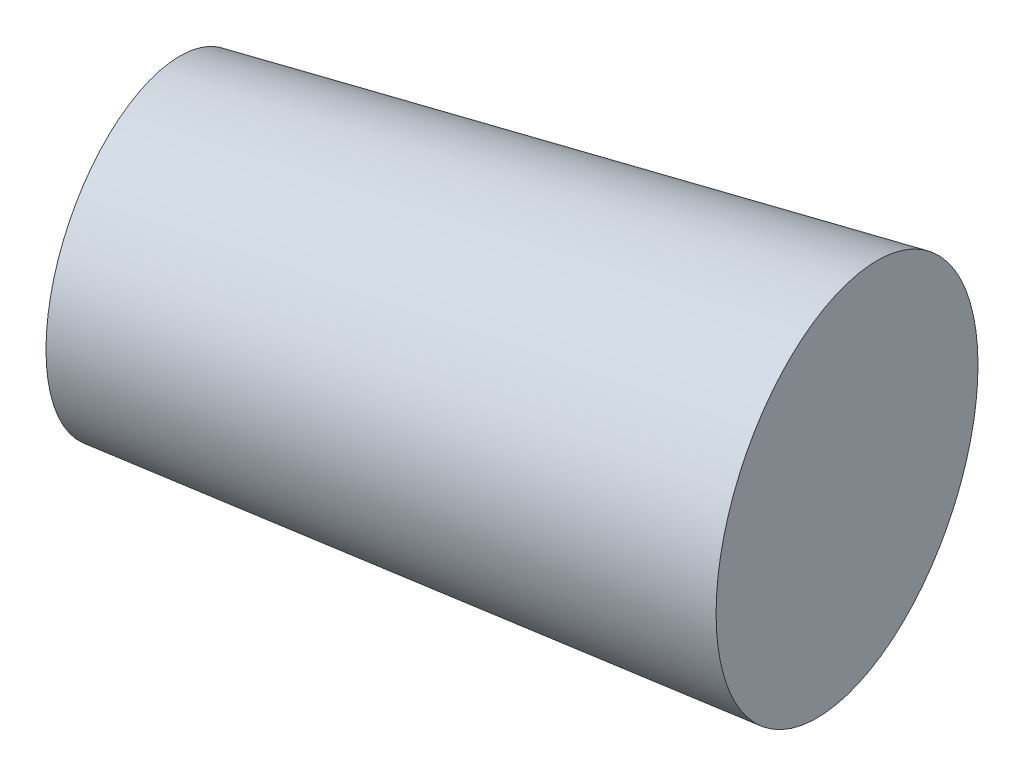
from build123d import *


with BuildPart() as part:
    # Esquisse1 → Base-R_volution (revolve)
    with BuildSketch(Plane(origin=(0, 0, 0), x_dir=(1, 0, 0), z_dir=(0, 1, 0)), mode=Mode.PRIVATE) as base_r_volution_sk:
        Polygon((-13.004565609, -3.166329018), (6.521455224, 1.587832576), (5.042910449, 7.66042719), (-14.233955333, 1.882950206), align=None)
    revolve(base_r_volution_sk.sketch.rotate(Axis((0, 0, 0), (0.9716151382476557, 0, -0.23656716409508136)), 180), axis=Axis((0, 0, 0), (0.9716151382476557, 0, -0.23656716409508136)))


solid = part.part
